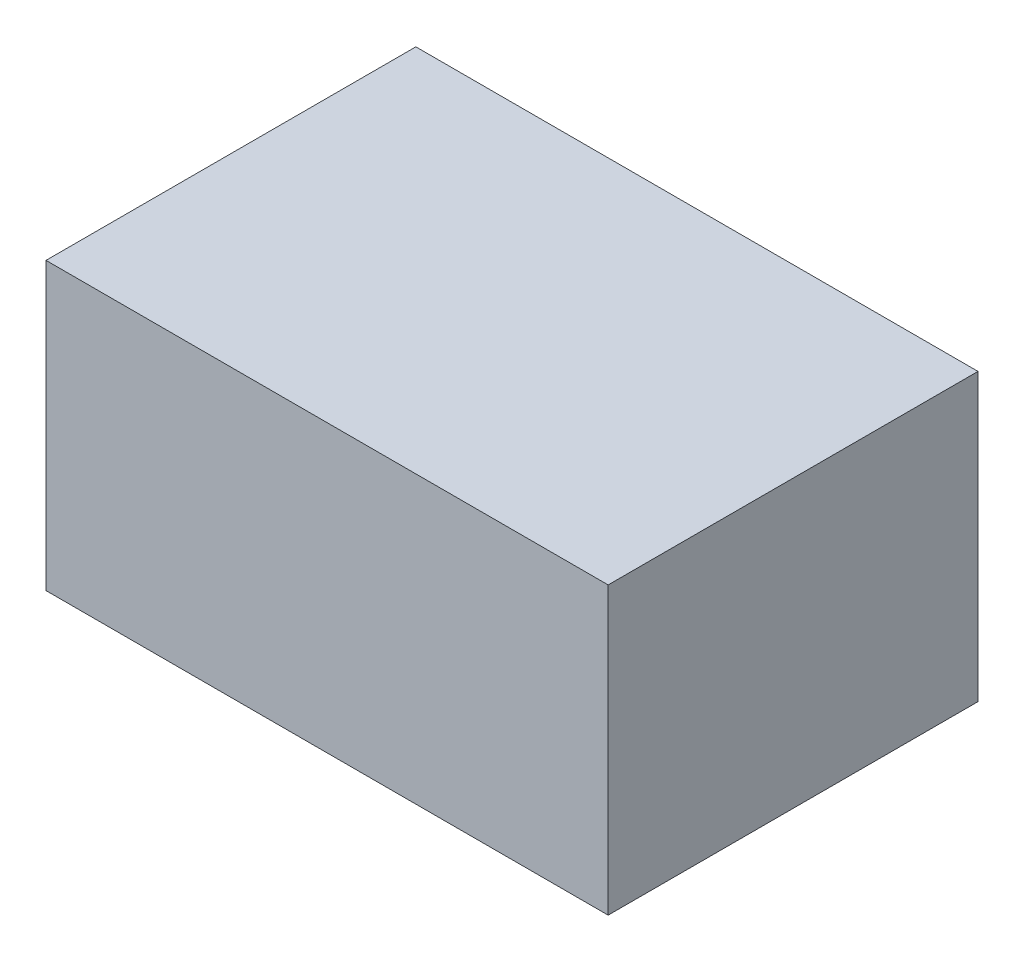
from build123d import *

# Parameters (mm, degrees)
SKETCH1_W           = 114
SKETCH1_H           = 75
BOSS_EXTRUDE1_DEPTH = 58


with BuildPart() as part:
    # Sketch1 → Boss-Extrude1 (new body)
    with BuildSketch(Plane(origin=(0, 0, 0), x_dir=(1, 0, 0), z_dir=(0, 1, 0))):
        with Locations((57, 37.5)):
            Rectangle(SKETCH1_W, SKETCH1_H)
    extrude(amount=BOSS_EXTRUDE1_DEPTH)


solid = part.part
